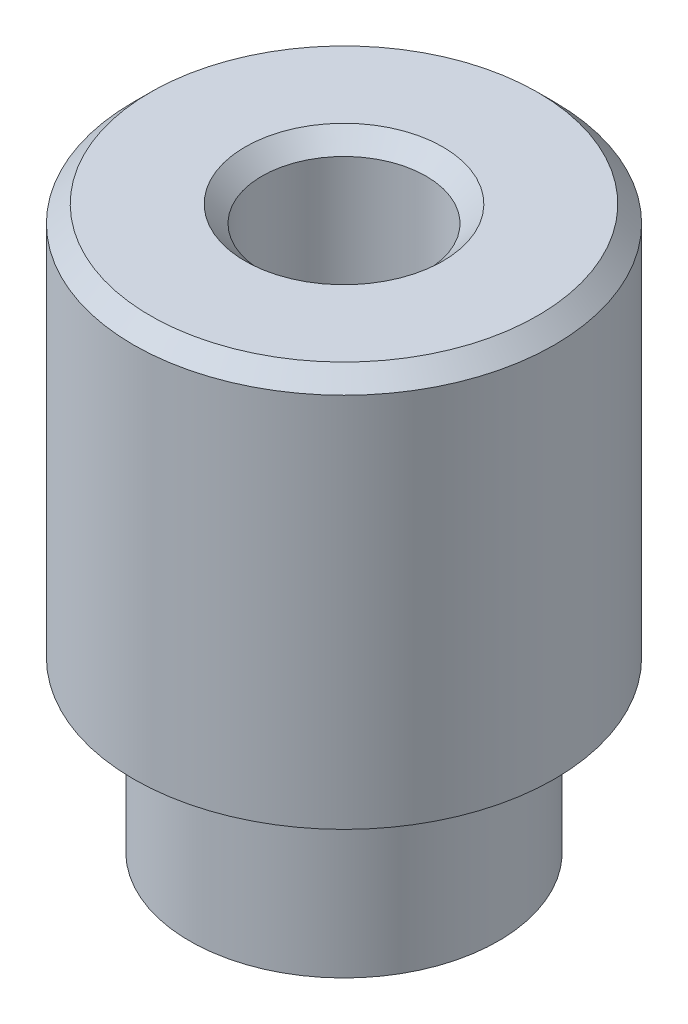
ISO-10303-21;
HEADER;
FILE_DESCRIPTION(('STEP AP214'),'2;1');
FILE_NAME('part.step','',(''),(''),'','','');
FILE_SCHEMA(('AUTOMOTIVE_DESIGN { 1 0 10303 214 1 1 1 1 }'));
ENDSEC;
DATA;
#1=APPLICATION_CONTEXT('core data for automotive mechanical design processes');
#2=APPLICATION_PROTOCOL_DEFINITION('international standard','automotive_design',2000,#1);
#3=PRODUCT_CONTEXT('',#1,'mechanical');
#4=PRODUCT('Part','Part','',(#3));
#5=PRODUCT_RELATED_PRODUCT_CATEGORY('part','',(#4));
#6=PRODUCT_DEFINITION_FORMATION('','',#4);
#7=PRODUCT_DEFINITION_CONTEXT('part definition',#1,'design');
#8=PRODUCT_DEFINITION('design','',#6,#7);
#9=PRODUCT_DEFINITION_SHAPE('','',#8);
#10=(LENGTH_UNIT() NAMED_UNIT(*) SI_UNIT(.MILLI.,.METRE.));
#11=(NAMED_UNIT(*) PLANE_ANGLE_UNIT() SI_UNIT($,.RADIAN.));
#12=(NAMED_UNIT(*) SI_UNIT($,.STERADIAN.) SOLID_ANGLE_UNIT());
#13=UNCERTAINTY_MEASURE_WITH_UNIT(LENGTH_MEASURE(1.E-05),#10,'distance_accuracy_value','');
#14=(GEOMETRIC_REPRESENTATION_CONTEXT(3) GLOBAL_UNCERTAINTY_ASSIGNED_CONTEXT((#13)) GLOBAL_UNIT_ASSIGNED_CONTEXT((#10,
#11,#12)) REPRESENTATION_CONTEXT('',''));
#15=CARTESIAN_POINT('',(0.,0.,0.));
#16=DIRECTION('',(0.,0.,1.));
#17=DIRECTION('',(1.,0.,0.));
#18=AXIS2_PLACEMENT_3D('',#15,#16,#17);
#19=CARTESIAN_POINT('',(0.,0.,0.));
#20=DIRECTION('',(0.,1.,0.));
#21=DIRECTION('',(0.,0.,1.));
#22=AXIS2_PLACEMENT_3D('',#19,#20,#21);
#23=PLANE('',#22);
#24=DIRECTION('',(0.,0.,1.));
#25=VECTOR('',#24,1.);
#26=CARTESIAN_POINT('',(1.6,0.,-2.04939015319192));
#27=LINE('',#26,#25);
#28=CARTESIAN_POINT('',(1.6,0.,-2.04939015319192));
#29=VERTEX_POINT('',#28);
#30=CARTESIAN_POINT('',(1.6,0.,2.04939015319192));
#31=VERTEX_POINT('',#30);
#32=EDGE_CURVE('E83',#29,#31,#27,.T.);
#33=ORIENTED_EDGE('',*,*,#32,.F.);
#34=CARTESIAN_POINT('',(0.,0.,0.));
#35=DIRECTION('',(0.,-1.,0.));
#36=DIRECTION('',(0.,0.,-1.));
#37=AXIS2_PLACEMENT_3D('',#34,#35,#36);
#38=CIRCLE('',#37,2.6);
#39=CARTESIAN_POINT('',(-1.6,0.,-2.04939015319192));
#40=VERTEX_POINT('',#39);
#41=EDGE_CURVE('E48',#40,#29,#38,.T.);
#42=ORIENTED_EDGE('',*,*,#41,.F.);
#43=DIRECTION('',(0.,0.,-1.));
#44=VECTOR('',#43,1.);
#45=CARTESIAN_POINT('',(-1.6,0.,-2.04939015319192));
#46=LINE('',#45,#44);
#47=CARTESIAN_POINT('',(-1.6,0.,2.04939015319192));
#48=VERTEX_POINT('',#47);
#49=EDGE_CURVE('E100',#48,#40,#46,.T.);
#50=ORIENTED_EDGE('',*,*,#49,.F.);
#51=CARTESIAN_POINT('',(0.,0.,0.));
#52=DIRECTION('',(0.,-1.,0.));
#53=DIRECTION('',(0.,0.,-1.));
#54=AXIS2_PLACEMENT_3D('',#51,#52,#53);
#55=CIRCLE('',#54,2.6);
#56=EDGE_CURVE('E106',#31,#48,#55,.T.);
#57=ORIENTED_EDGE('',*,*,#56,.F.);
#58=EDGE_LOOP('',(#33,#42,#50,#57));
#59=FACE_BOUND('',#58,.T.);
#60=CARTESIAN_POINT('',(0.,0.,0.));
#61=DIRECTION('',(0.,-1.,0.));
#62=DIRECTION('',(0.,0.,-1.));
#63=AXIS2_PLACEMENT_3D('',#60,#61,#62);
#64=CIRCLE('',#63,5.5);
#65=CARTESIAN_POINT('',(0.,0.,-5.5));
#66=VERTEX_POINT('',#65);
#67=EDGE_CURVE('E127',#66,#66,#64,.T.);
#68=ORIENTED_EDGE('',*,*,#67,.T.);
#69=EDGE_LOOP('',(#68));
#70=FACE_BOUND('',#69,.T.);
#71=ADVANCED_FACE('F33',(#59,#70),#23,.F.);
#72=CARTESIAN_POINT('',(0.,0.,0.));
#73=DIRECTION('',(0.,-1.,0.));
#74=DIRECTION('',(0.,0.,-1.));
#75=AXIS2_PLACEMENT_3D('',#72,#73,#74);
#76=CYLINDRICAL_SURFACE('',#75,5.5);
#77=ORIENTED_EDGE('',*,*,#67,.F.);
#78=EDGE_LOOP('',(#77));
#79=FACE_BOUND('',#78,.T.);
#80=CARTESIAN_POINT('',(0.,5.4,0.));
#81=DIRECTION('',(0.,-1.,0.));
#82=DIRECTION('',(0.,0.,-1.));
#83=AXIS2_PLACEMENT_3D('',#80,#81,#82);
#84=CIRCLE('',#83,5.5);
#85=CARTESIAN_POINT('',(0.,5.4,-5.5));
#86=VERTEX_POINT('',#85);
#87=EDGE_CURVE('E124',#86,#86,#84,.T.);
#88=ORIENTED_EDGE('',*,*,#87,.T.);
#89=EDGE_LOOP('',(#88));
#90=FACE_BOUND('',#89,.T.);
#91=ADVANCED_FACE('F160',(#79,#90),#76,.T.);
#92=CARTESIAN_POINT('',(0.,5.4,0.));
#93=DIRECTION('',(0.,-1.,0.));
#94=DIRECTION('',(0.,0.,-1.));
#95=AXIS2_PLACEMENT_3D('',#92,#93,#94);
#96=TOROIDAL_SURFACE('',#95,6.1,0.6);
#97=ORIENTED_EDGE('',*,*,#87,.F.);
#98=EDGE_LOOP('',(#97));
#99=FACE_BOUND('',#98,.T.);
#100=CARTESIAN_POINT('',(0.,6.,0.));
#101=DIRECTION('',(0.,-1.,0.));
#102=DIRECTION('',(0.,0.,-1.));
#103=AXIS2_PLACEMENT_3D('',#100,#101,#102);
#104=CIRCLE('',#103,6.1);
#105=CARTESIAN_POINT('',(0.,6.,-6.1));
#106=VERTEX_POINT('',#105);
#107=EDGE_CURVE('E121',#106,#106,#104,.T.);
#108=ORIENTED_EDGE('',*,*,#107,.T.);
#109=EDGE_LOOP('',(#108));
#110=FACE_BOUND('',#109,.T.);
#111=ADVANCED_FACE('F154',(#99,#110),#96,.F.);
#112=CARTESIAN_POINT('',(-6.1,6.,0.));
#113=DIRECTION('',(0.,1.,0.));
#114=DIRECTION('',(0.,0.,1.));
#115=AXIS2_PLACEMENT_3D('',#112,#113,#114);
#116=PLANE('',#115);
#117=ORIENTED_EDGE('',*,*,#107,.F.);
#118=EDGE_LOOP('',(#117));
#119=FACE_BOUND('',#118,.T.);
#120=CARTESIAN_POINT('',(0.,6.,0.));
#121=DIRECTION('',(0.,-1.,0.));
#122=DIRECTION('',(0.,0.,-1.));
#123=AXIS2_PLACEMENT_3D('',#120,#121,#122);
#124=CIRCLE('',#123,7.5);
#125=CARTESIAN_POINT('',(0.,6.,-7.5));
#126=VERTEX_POINT('',#125);
#127=EDGE_CURVE('E118',#126,#126,#124,.T.);
#128=ORIENTED_EDGE('',*,*,#127,.T.);
#129=EDGE_LOOP('',(#128));
#130=FACE_BOUND('',#129,.T.);
#131=ADVANCED_FACE('F149',(#119,#130),#116,.F.);
#132=CARTESIAN_POINT('',(0.,0.,0.));
#133=DIRECTION('',(0.,-1.,0.));
#134=DIRECTION('',(0.,0.,-1.));
#135=AXIS2_PLACEMENT_3D('',#132,#133,#134);
#136=CYLINDRICAL_SURFACE('',#135,7.5);
#137=CARTESIAN_POINT('',(0.,19.4,0.));
#138=DIRECTION('',(0.,-1.,0.));
#139=DIRECTION('',(0.,0.,-1.));
#140=AXIS2_PLACEMENT_3D('',#137,#138,#139);
#141=CIRCLE('',#140,7.5);
#142=CARTESIAN_POINT('',(0.,19.4,-7.5));
#143=VERTEX_POINT('',#142);
#144=EDGE_CURVE('E130',#143,#143,#141,.T.);
#145=ORIENTED_EDGE('',*,*,#144,.T.);
#146=EDGE_LOOP('',(#145));
#147=FACE_BOUND('',#146,.T.);
#148=ORIENTED_EDGE('',*,*,#127,.F.);
#149=EDGE_LOOP('',(#148));
#150=FACE_BOUND('',#149,.T.);
#151=ADVANCED_FACE('F146',(#147,#150),#136,.T.);
#152=CARTESIAN_POINT('',(-7.5,20.,0.));
#153=DIRECTION('',(0.,-1.,0.));
#154=DIRECTION('',(0.,0.,-1.));
#155=AXIS2_PLACEMENT_3D('',#152,#153,#154);
#156=PLANE('',#155);
#157=CARTESIAN_POINT('',(0.,20.,0.));
#158=DIRECTION('',(0.,-1.,0.));
#159=DIRECTION('',(0.,0.,-1.));
#160=AXIS2_PLACEMENT_3D('',#157,#158,#159);
#161=CIRCLE('',#160,6.9);
#162=CARTESIAN_POINT('',(0.,20.,-6.9));
#163=VERTEX_POINT('',#162);
#164=EDGE_CURVE('E41',#163,#163,#161,.F.);
#165=ORIENTED_EDGE('',*,*,#164,.T.);
#166=EDGE_LOOP('',(#165));
#167=FACE_BOUND('',#166,.T.);
#168=CARTESIAN_POINT('',(0.,20.,0.));
#169=DIRECTION('',(0.,-1.,0.));
#170=DIRECTION('',(0.,0.,-1.));
#171=AXIS2_PLACEMENT_3D('',#168,#169,#170);
#172=CIRCLE('',#171,3.525);
#173=CARTESIAN_POINT('',(0.,20.,-3.525));
#174=VERTEX_POINT('',#173);
#175=EDGE_CURVE('E133',#174,#174,#172,.T.);
#176=ORIENTED_EDGE('',*,*,#175,.T.);
#177=EDGE_LOOP('',(#176));
#178=FACE_BOUND('',#177,.T.);
#179=ADVANCED_FACE('F138',(#167,#178),#156,.F.);
#180=CARTESIAN_POINT('',(0.,0.,0.));
#181=DIRECTION('',(0.,-1.,0.));
#182=DIRECTION('',(0.,0.,-1.));
#183=AXIS2_PLACEMENT_3D('',#180,#181,#182);
#184=CYLINDRICAL_SURFACE('',#183,2.925);
#185=CARTESIAN_POINT('',(0.,19.4,0.));
#186=DIRECTION('',(0.,-1.,0.));
#187=DIRECTION('',(0.,0.,-1.));
#188=AXIS2_PLACEMENT_3D('',#185,#186,#187);
#189=CIRCLE('',#188,2.925);
#190=CARTESIAN_POINT('',(0.,19.4,-2.925));
#191=VERTEX_POINT('',#190);
#192=EDGE_CURVE('E11',#191,#191,#189,.F.);
#193=ORIENTED_EDGE('',*,*,#192,.T.);
#194=EDGE_LOOP('',(#193));
#195=FACE_BOUND('',#194,.T.);
#196=CARTESIAN_POINT('',(0.,9.50000000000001,0.));
#197=DIRECTION('',(0.,-1.,0.));
#198=DIRECTION('',(0.,0.,-1.));
#199=AXIS2_PLACEMENT_3D('',#196,#197,#198);
#200=CIRCLE('',#199,2.925);
#201=CARTESIAN_POINT('',(0.,9.50000000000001,-2.925));
#202=VERTEX_POINT('',#201);
#203=EDGE_CURVE('E115',#202,#202,#200,.T.);
#204=ORIENTED_EDGE('',*,*,#203,.T.);
#205=EDGE_LOOP('',(#204));
#206=FACE_BOUND('',#205,.T.);
#207=ADVANCED_FACE('F195',(#195,#206),#184,.F.);
#208=CARTESIAN_POINT('',(0.,9.5,0.));
#209=DIRECTION('',(0.,-1.,0.));
#210=DIRECTION('',(0.,0.,-1.));
#211=AXIS2_PLACEMENT_3D('',#208,#209,#210);
#212=DEGENERATE_TOROIDAL_SURFACE('',#211,1.425,1.5,.T.);
#213=ORIENTED_EDGE('',*,*,#203,.F.);
#214=EDGE_LOOP('',(#213));
#215=FACE_BOUND('',#214,.T.);
#216=CARTESIAN_POINT('',(0.,8.,0.));
#217=DIRECTION('',(0.,-1.,0.));
#218=DIRECTION('',(0.,0.,-1.));
#219=AXIS2_PLACEMENT_3D('',#216,#217,#218);
#220=CIRCLE('',#219,1.425);
#221=CARTESIAN_POINT('',(0.,8.,-1.425));
#222=VERTEX_POINT('',#221);
#223=EDGE_CURVE('E110',#222,#222,#220,.F.);
#224=ORIENTED_EDGE('',*,*,#223,.F.);
#225=EDGE_LOOP('',(#224));
#226=FACE_BOUND('',#225,.T.);
#227=ADVANCED_FACE('F192',(#215,#226),#212,.F.);
#228=CARTESIAN_POINT('',(0.,8.,0.));
#229=DIRECTION('',(0.,-1.,0.));
#230=DIRECTION('',(0.,0.,-1.));
#231=AXIS2_PLACEMENT_3D('',#228,#229,#230);
#232=PLANE('',#231);
#233=CARTESIAN_POINT('',(0.,8.,0.));
#234=DIRECTION('',(0.,-1.,0.));
#235=DIRECTION('',(0.,0.,-1.));
#236=AXIS2_PLACEMENT_3D('',#233,#234,#235);
#237=CIRCLE('',#236,2.6);
#238=CARTESIAN_POINT('',(-1.6,8.,-2.04939015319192));
#239=VERTEX_POINT('',#238);
#240=CARTESIAN_POINT('',(1.6,8.,-2.04939015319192));
#241=VERTEX_POINT('',#240);
#242=EDGE_CURVE('E98',#239,#241,#237,.T.);
#243=ORIENTED_EDGE('',*,*,#242,.T.);
#244=DIRECTION('',(0.,0.,1.));
#245=VECTOR('',#244,1.);
#246=CARTESIAN_POINT('',(1.6,8.,-2.04939015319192));
#247=LINE('',#246,#245);
#248=CARTESIAN_POINT('',(1.6,8.,2.04939015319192));
#249=VERTEX_POINT('',#248);
#250=EDGE_CURVE('E80',#241,#249,#247,.T.);
#251=ORIENTED_EDGE('',*,*,#250,.T.);
#252=CARTESIAN_POINT('',(0.,8.,0.));
#253=DIRECTION('',(0.,-1.,0.));
#254=DIRECTION('',(0.,0.,-1.));
#255=AXIS2_PLACEMENT_3D('',#252,#253,#254);
#256=CIRCLE('',#255,2.6);
#257=CARTESIAN_POINT('',(-1.6,8.,2.04939015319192));
#258=VERTEX_POINT('',#257);
#259=EDGE_CURVE('E90',#249,#258,#256,.T.);
#260=ORIENTED_EDGE('',*,*,#259,.T.);
#261=DIRECTION('',(0.,0.,-1.));
#262=VECTOR('',#261,1.);
#263=CARTESIAN_POINT('',(-1.6,8.,-2.04939015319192));
#264=LINE('',#263,#262);
#265=EDGE_CURVE('E94',#258,#239,#264,.T.);
#266=ORIENTED_EDGE('',*,*,#265,.T.);
#267=EDGE_LOOP('',(#243,#251,#260,#266));
#268=FACE_BOUND('',#267,.T.);
#269=ORIENTED_EDGE('',*,*,#223,.T.);
#270=EDGE_LOOP('',(#269));
#271=FACE_BOUND('',#270,.T.);
#272=ADVANCED_FACE('F96',(#268,#271),#232,.T.);
#273=CARTESIAN_POINT('',(0.,8.,0.));
#274=DIRECTION('',(0.,-1.,0.));
#275=DIRECTION('',(0.,0.,-1.));
#276=AXIS2_PLACEMENT_3D('',#273,#274,#275);
#277=CYLINDRICAL_SURFACE('',#276,2.6);
#278=ORIENTED_EDGE('',*,*,#41,.T.);
#279=DIRECTION('',(0.,-1.,0.));
#280=VECTOR('',#279,1.);
#281=CARTESIAN_POINT('',(1.6,8.,-2.04939015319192));
#282=LINE('',#281,#280);
#283=EDGE_CURVE('E71',#241,#29,#282,.T.);
#284=ORIENTED_EDGE('',*,*,#283,.F.);
#285=ORIENTED_EDGE('',*,*,#242,.F.);
#286=DIRECTION('',(0.,-1.,0.));
#287=VECTOR('',#286,1.);
#288=CARTESIAN_POINT('',(-1.6,8.,-2.04939015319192));
#289=LINE('',#288,#287);
#290=EDGE_CURVE('E56',#239,#40,#289,.T.);
#291=ORIENTED_EDGE('',*,*,#290,.T.);
#292=EDGE_LOOP('',(#278,#284,#285,#291));
#293=FACE_BOUND('',#292,.T.);
#294=ADVANCED_FACE('F180',(#293),#277,.F.);
#295=CARTESIAN_POINT('',(-1.6,8.,-2.04939015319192));
#296=DIRECTION('',(-1.,0.,0.));
#297=DIRECTION('',(0.,0.,1.));
#298=AXIS2_PLACEMENT_3D('',#295,#296,#297);
#299=PLANE('',#298);
#300=ORIENTED_EDGE('',*,*,#49,.T.);
#301=ORIENTED_EDGE('',*,*,#290,.F.);
#302=ORIENTED_EDGE('',*,*,#265,.F.);
#303=DIRECTION('',(0.,-1.,0.));
#304=VECTOR('',#303,1.);
#305=CARTESIAN_POINT('',(-1.6,8.,2.04939015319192));
#306=LINE('',#305,#304);
#307=EDGE_CURVE('E87',#258,#48,#306,.T.);
#308=ORIENTED_EDGE('',*,*,#307,.T.);
#309=EDGE_LOOP('',(#300,#301,#302,#308));
#310=FACE_BOUND('',#309,.T.);
#311=ADVANCED_FACE('F178',(#310),#299,.F.);
#312=CARTESIAN_POINT('',(0.,8.,0.));
#313=DIRECTION('',(0.,-1.,0.));
#314=DIRECTION('',(0.,0.,-1.));
#315=AXIS2_PLACEMENT_3D('',#312,#313,#314);
#316=CYLINDRICAL_SURFACE('',#315,2.6);
#317=ORIENTED_EDGE('',*,*,#56,.T.);
#318=ORIENTED_EDGE('',*,*,#307,.F.);
#319=ORIENTED_EDGE('',*,*,#259,.F.);
#320=DIRECTION('',(0.,-1.,0.));
#321=VECTOR('',#320,1.);
#322=CARTESIAN_POINT('',(1.6,8.,2.04939015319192));
#323=LINE('',#322,#321);
#324=EDGE_CURVE('E76',#249,#31,#323,.T.);
#325=ORIENTED_EDGE('',*,*,#324,.T.);
#326=EDGE_LOOP('',(#317,#318,#319,#325));
#327=FACE_BOUND('',#326,.T.);
#328=ADVANCED_FACE('F91',(#327),#316,.F.);
#329=CARTESIAN_POINT('',(1.6,8.,-2.04939015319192));
#330=DIRECTION('',(1.,0.,0.));
#331=DIRECTION('',(0.,0.,-1.));
#332=AXIS2_PLACEMENT_3D('',#329,#330,#331);
#333=PLANE('',#332);
#334=ORIENTED_EDGE('',*,*,#32,.T.);
#335=ORIENTED_EDGE('',*,*,#324,.F.);
#336=ORIENTED_EDGE('',*,*,#250,.F.);
#337=ORIENTED_EDGE('',*,*,#283,.T.);
#338=EDGE_LOOP('',(#334,#335,#336,#337));
#339=FACE_BOUND('',#338,.T.);
#340=ADVANCED_FACE('F78',(#339),#333,.F.);
#341=CARTESIAN_POINT('',(0.,19.4,0.));
#342=DIRECTION('',(0.,-1.,0.));
#343=DIRECTION('',(0.,0.,-1.));
#344=AXIS2_PLACEMENT_3D('',#341,#342,#343);
#345=CONICAL_SURFACE('',#344,7.5,0.785398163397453);
#346=ORIENTED_EDGE('',*,*,#164,.F.);
#347=EDGE_LOOP('',(#346));
#348=FACE_BOUND('',#347,.T.);
#349=ORIENTED_EDGE('',*,*,#144,.F.);
#350=EDGE_LOOP('',(#349));
#351=FACE_BOUND('',#350,.T.);
#352=ADVANCED_FACE('F141',(#348,#351),#345,.T.);
#353=CARTESIAN_POINT('',(0.,20.,0.));
#354=DIRECTION('',(0.,1.,0.));
#355=DIRECTION('',(0.,0.,1.));
#356=AXIS2_PLACEMENT_3D('',#353,#354,#355);
#357=CONICAL_SURFACE('',#356,3.525,0.785398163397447);
#358=ORIENTED_EDGE('',*,*,#192,.F.);
#359=EDGE_LOOP('',(#358));
#360=FACE_BOUND('',#359,.T.);
#361=ORIENTED_EDGE('',*,*,#175,.F.);
#362=EDGE_LOOP('',(#361));
#363=FACE_BOUND('',#362,.T.);
#364=ADVANCED_FACE('F35',(#360,#363),#357,.F.);
#365=CLOSED_SHELL('',(#71,#91,#111,#131,#151,#179,#207,#227,#272,#294,#311,#328,#340,#352,#364));
#366=MANIFOLD_SOLID_BREP('B2',#365);
#367=ADVANCED_BREP_SHAPE_REPRESENTATION('',(#18,#366),#14);
#368=SHAPE_DEFINITION_REPRESENTATION(#9,#367);
ENDSEC;
END-ISO-10303-21;
